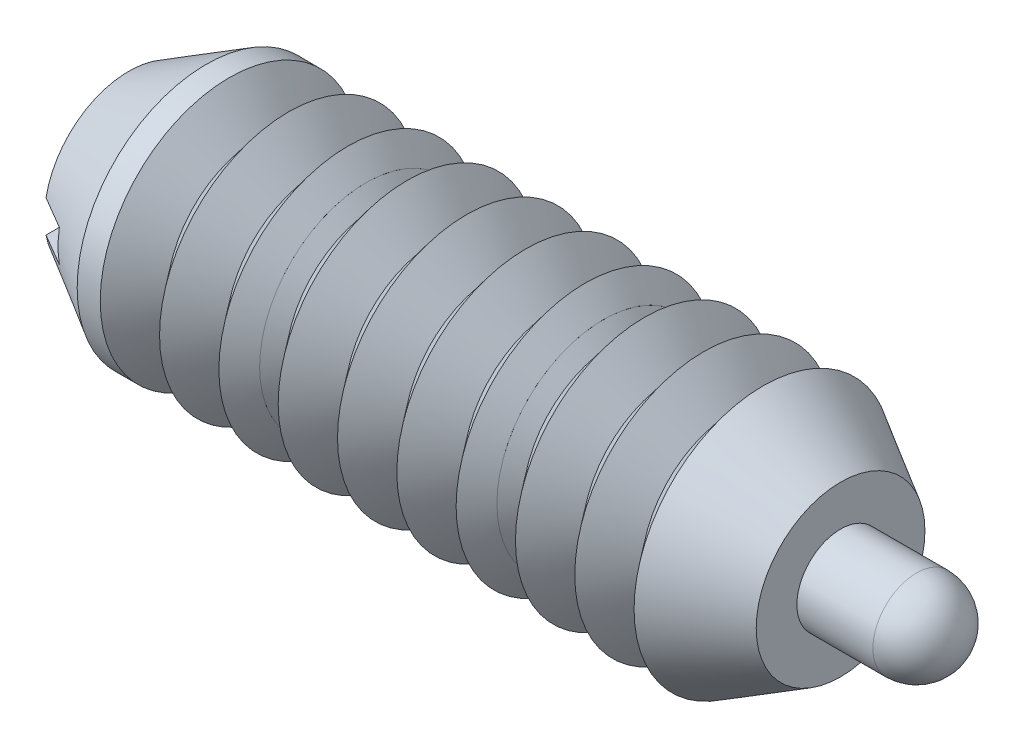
ISO-10303-21;
HEADER;
FILE_DESCRIPTION(('STEP AP214'),'2;1');
FILE_NAME('part.step','',(''),(''),'','','');
FILE_SCHEMA(('AUTOMOTIVE_DESIGN { 1 0 10303 214 1 1 1 1 }'));
ENDSEC;
DATA;
#1=APPLICATION_CONTEXT('core data for automotive mechanical design processes');
#2=APPLICATION_PROTOCOL_DEFINITION('international standard','automotive_design',2000,#1);
#3=PRODUCT_CONTEXT('',#1,'mechanical');
#4=PRODUCT('Part','Part','',(#3));
#5=PRODUCT_RELATED_PRODUCT_CATEGORY('part','',(#4));
#6=PRODUCT_DEFINITION_FORMATION('','',#4);
#7=PRODUCT_DEFINITION_CONTEXT('part definition',#1,'design');
#8=PRODUCT_DEFINITION('design','',#6,#7);
#9=PRODUCT_DEFINITION_SHAPE('','',#8);
#10=(LENGTH_UNIT() NAMED_UNIT(*) SI_UNIT(.MILLI.,.METRE.));
#11=(NAMED_UNIT(*) PLANE_ANGLE_UNIT() SI_UNIT($,.RADIAN.));
#12=(NAMED_UNIT(*) SI_UNIT($,.STERADIAN.) SOLID_ANGLE_UNIT());
#13=UNCERTAINTY_MEASURE_WITH_UNIT(LENGTH_MEASURE(1.E-05),#10,'distance_accuracy_value','');
#14=(GEOMETRIC_REPRESENTATION_CONTEXT(3) GLOBAL_UNCERTAINTY_ASSIGNED_CONTEXT((#13)) GLOBAL_UNIT_ASSIGNED_CONTEXT((#10,
#11,#12)) REPRESENTATION_CONTEXT('',''));
#15=CARTESIAN_POINT('',(0.,0.,0.));
#16=DIRECTION('',(0.,0.,1.));
#17=DIRECTION('',(1.,0.,0.));
#18=AXIS2_PLACEMENT_3D('',#15,#16,#17);
#19=CARTESIAN_POINT('',(8.18134,0.,0.));
#20=DIRECTION('',(-1.,0.,0.));
#21=DIRECTION('',(0.,-0.719424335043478,-0.694570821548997));
#22=AXIS2_PLACEMENT_3D('',#19,#20,#21);
#23=PLANE('',#22);
#24=CARTESIAN_POINT('',(8.18134,0.,0.));
#25=DIRECTION('',(1.,0.,0.));
#26=DIRECTION('',(0.,0.719424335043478,0.694570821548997));
#27=AXIS2_PLACEMENT_3D('',#24,#25,#26);
#28=CIRCLE('',#27,0.5842);
#29=CARTESIAN_POINT('',(8.18134,0.4202876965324,0.405768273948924));
#30=VERTEX_POINT('',#29);
#31=EDGE_CURVE('P0_E10',#30,#30,#28,.T.);
#32=ORIENTED_EDGE('',*,*,#31,.F.);
#33=EDGE_LOOP('',(#32));
#34=FACE_BOUND('',#33,.T.);
#35=ADVANCED_FACE('P0_F14',(#34),#23,.T.);
#36=CARTESIAN_POINT('',(8.29818,0.,0.));
#37=DIRECTION('',(1.,0.,0.));
#38=DIRECTION('',(0.,0.719424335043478,0.694570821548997));
#39=AXIS2_PLACEMENT_3D('',#36,#37,#38);
#40=CONICAL_SURFACE('',#39,0.70104,0.785398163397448);
#41=ORIENTED_EDGE('',*,*,#31,.T.);
#42=EDGE_LOOP('',(#41));
#43=FACE_BOUND('',#42,.T.);
#44=CARTESIAN_POINT('',(8.29818,0.,0.));
#45=DIRECTION('',(1.,0.,0.));
#46=DIRECTION('',(0.,0.719424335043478,0.694570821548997));
#47=AXIS2_PLACEMENT_3D('',#44,#45,#46);
#48=CIRCLE('',#47,0.70104);
#49=CARTESIAN_POINT('',(8.29818,0.50434523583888,0.486921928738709));
#50=VERTEX_POINT('',#49);
#51=EDGE_CURVE('P0_E20',#50,#50,#48,.T.);
#52=ORIENTED_EDGE('',*,*,#51,.F.);
#53=EDGE_LOOP('',(#52));
#54=FACE_BOUND('',#53,.T.);
#55=ADVANCED_FACE('P0_F54',(#43,#54),#40,.T.);
#56=CARTESIAN_POINT('',(11.1252,0.,0.));
#57=DIRECTION('',(1.,0.,0.));
#58=DIRECTION('',(0.,0.719424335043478,0.694570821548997));
#59=AXIS2_PLACEMENT_3D('',#56,#57,#58);
#60=CYLINDRICAL_SURFACE('',#59,0.70104);
#61=ORIENTED_EDGE('',*,*,#51,.T.);
#62=EDGE_LOOP('',(#61));
#63=FACE_BOUND('',#62,.T.);
#64=CARTESIAN_POINT('',(9.14736718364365,0.,0.));
#65=DIRECTION('',(1.,0.,0.));
#66=DIRECTION('',(0.,0.719424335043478,0.694570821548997));
#67=AXIS2_PLACEMENT_3D('',#64,#65,#66);
#68=CIRCLE('',#67,0.70104);
#69=CARTESIAN_POINT('',(9.14736718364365,0.50434523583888,0.486921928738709));
#70=VERTEX_POINT('',#69);
#71=EDGE_CURVE('P0_E24',#70,#70,#68,.T.);
#72=ORIENTED_EDGE('',*,*,#71,.F.);
#73=EDGE_LOOP('',(#72));
#74=FACE_BOUND('',#73,.T.);
#75=ADVANCED_FACE('P0_F50',(#63,#74),#60,.T.);
#76=CARTESIAN_POINT('',(9.34974,0.,0.));
#77=DIRECTION('',(-1.,0.,0.));
#78=DIRECTION('',(0.,-0.719424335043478,-0.694570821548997));
#79=AXIS2_PLACEMENT_3D('',#76,#77,#78);
#80=CONICAL_SURFACE('',#79,0.5842,0.523598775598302);
#81=ORIENTED_EDGE('',*,*,#71,.T.);
#82=EDGE_LOOP('',(#81));
#83=FACE_BOUND('',#82,.T.);
#84=CARTESIAN_POINT('',(9.34974,0.,0.));
#85=DIRECTION('',(1.,0.,0.));
#86=DIRECTION('',(0.,0.719424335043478,0.694570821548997));
#87=AXIS2_PLACEMENT_3D('',#84,#85,#86);
#88=CIRCLE('',#87,0.5842);
#89=CARTESIAN_POINT('',(9.34974,0.4202876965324,0.405768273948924));
#90=VERTEX_POINT('',#89);
#91=EDGE_CURVE('P0_E28',#90,#90,#88,.T.);
#92=ORIENTED_EDGE('',*,*,#91,.F.);
#93=EDGE_LOOP('',(#92));
#94=FACE_BOUND('',#93,.T.);
#95=ADVANCED_FACE('P0_F41',(#83,#94),#80,.T.);
#96=CARTESIAN_POINT('',(11.1252,0.,0.));
#97=DIRECTION('',(1.,0.,0.));
#98=DIRECTION('',(0.,0.719424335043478,0.694570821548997));
#99=AXIS2_PLACEMENT_3D('',#96,#97,#98);
#100=CYLINDRICAL_SURFACE('',#99,0.5842);
#101=ORIENTED_EDGE('',*,*,#91,.T.);
#102=EDGE_LOOP('',(#101));
#103=FACE_BOUND('',#102,.T.);
#104=CARTESIAN_POINT('',(10.541,0.,0.));
#105=DIRECTION('',(1.,0.,0.));
#106=DIRECTION('',(0.,0.719424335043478,0.694570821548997));
#107=AXIS2_PLACEMENT_3D('',#104,#105,#106);
#108=CIRCLE('',#107,0.5842);
#109=CARTESIAN_POINT('',(10.541,0.4202876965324,0.405768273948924));
#110=VERTEX_POINT('',#109);
#111=EDGE_CURVE('P0_E33',#110,#110,#108,.T.);
#112=ORIENTED_EDGE('',*,*,#111,.F.);
#113=EDGE_LOOP('',(#112));
#114=FACE_BOUND('',#113,.T.);
#115=ADVANCED_FACE('P0_F39',(#103,#114),#100,.T.);
#116=CARTESIAN_POINT('',(10.541,0.,0.));
#117=DIRECTION('',(1.,0.,0.));
#118=DIRECTION('',(0.,-0.719424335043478,-0.694570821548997));
#119=AXIS2_PLACEMENT_3D('',#116,#117,#118);
#120=SPHERICAL_SURFACE('',#119,0.5842);
#121=ORIENTED_EDGE('',*,*,#111,.T.);
#122=EDGE_LOOP('',(#121));
#123=FACE_BOUND('',#122,.T.);
#124=ADVANCED_FACE('P0_F37',(#123),#120,.T.);
#125=CLOSED_SHELL('',(#35,#55,#75,#95,#115,#124));
#126=MANIFOLD_SOLID_BREP('P0_B1',#125);
#127=CARTESIAN_POINT('',(3.175,3.4544,-1.7272));
#128=DIRECTION('',(-1.,0.,0.));
#129=DIRECTION('',(0.,-1.,0.));
#130=AXIS2_PLACEMENT_3D('',#127,#128,#129);
#131=PLANE('',#130);
#132=CARTESIAN_POINT('',(3.175,0.,0.));
#133=DIRECTION('',(-1.,0.,0.));
#134=DIRECTION('',(0.,-1.,0.));
#135=AXIS2_PLACEMENT_3D('',#132,#133,#134);
#136=CIRCLE('',#135,1.42423016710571);
#137=CARTESIAN_POINT('',(3.175,-1.42423016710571,0.));
#138=VERTEX_POINT('',#137);
#139=EDGE_CURVE('P1_E31',#138,#138,#136,.F.);
#140=ORIENTED_EDGE('',*,*,#139,.F.);
#141=EDGE_LOOP('',(#140));
#142=FACE_BOUND('',#141,.T.);
#143=CARTESIAN_POINT('',(3.175,0.,0.));
#144=DIRECTION('',(1.,0.,0.));
#145=DIRECTION('',(0.,0.,-1.));
#146=AXIS2_PLACEMENT_3D('',#143,#144,#145);
#147=CIRCLE('',#146,0.726440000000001);
#148=CARTESIAN_POINT('',(3.175,0.,0.726440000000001));
#149=VERTEX_POINT('',#148);
#150=EDGE_CURVE('P1_E47',#149,#149,#147,.T.);
#151=ORIENTED_EDGE('',*,*,#150,.T.);
#152=EDGE_LOOP('',(#151));
#153=FACE_BOUND('',#152,.T.);
#154=ADVANCED_FACE('P1_F14',(#142,#153),#131,.T.);
#155=CARTESIAN_POINT('',(6.35,3.4544,-1.7272));
#156=DIRECTION('',(1.,0.,0.));
#157=DIRECTION('',(0.,1.,0.));
#158=AXIS2_PLACEMENT_3D('',#155,#156,#157);
#159=PLANE('',#158);
#160=CARTESIAN_POINT('',(6.35,0.,0.));
#161=DIRECTION('',(1.,0.,0.));
#162=DIRECTION('',(0.,1.,0.));
#163=AXIS2_PLACEMENT_3D('',#160,#161,#162);
#164=CIRCLE('',#163,1.42423016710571);
#165=CARTESIAN_POINT('',(6.35,1.42423016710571,0.));
#166=VERTEX_POINT('',#165);
#167=EDGE_CURVE('P1_E33',#166,#166,#164,.F.);
#168=ORIENTED_EDGE('',*,*,#167,.F.);
#169=EDGE_LOOP('',(#168));
#170=FACE_BOUND('',#169,.T.);
#171=CARTESIAN_POINT('',(6.35,0.,0.));
#172=DIRECTION('',(1.,0.,0.));
#173=DIRECTION('',(0.,1.,0.));
#174=AXIS2_PLACEMENT_3D('',#171,#172,#173);
#175=CIRCLE('',#174,0.726440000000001);
#176=CARTESIAN_POINT('',(6.35,0.,0.726440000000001));
#177=VERTEX_POINT('',#176);
#178=EDGE_CURVE('P1_E18',#177,#177,#175,.F.);
#179=ORIENTED_EDGE('',*,*,#178,.T.);
#180=EDGE_LOOP('',(#179));
#181=FACE_BOUND('',#180,.T.);
#182=ADVANCED_FACE('P1_F65',(#170,#181),#159,.T.);
#183=CARTESIAN_POINT('',(4.91680500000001,0.,0.));
#184=DIRECTION('',(1.,0.,0.));
#185=DIRECTION('',(0.,0.,-1.));
#186=AXIS2_PLACEMENT_3D('',#183,#184,#185);
#187=CONICAL_SURFACE('',#186,1.23150328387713,0.895664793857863);
#188=CARTESIAN_POINT('',(5.31368000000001,0.,0.));
#189=DIRECTION('',(-1.,0.,0.));
#190=DIRECTION('',(0.,0.,1.));
#191=AXIS2_PLACEMENT_3D('',#188,#189,#190);
#192=CIRCLE('',#191,1.7272);
#193=CARTESIAN_POINT('',(5.31368000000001,0.,1.7272));
#194=VERTEX_POINT('',#193);
#195=EDGE_CURVE('P1_E54',#194,#194,#192,.T.);
#196=ORIENTED_EDGE('',*,*,#195,.T.);
#197=EDGE_LOOP('',(#196));
#198=FACE_BOUND('',#197,.T.);
#199=CARTESIAN_POINT('',(4.91680500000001,0.,0.));
#200=DIRECTION('',(-1.,0.,0.));
#201=DIRECTION('',(0.,0.,1.));
#202=AXIS2_PLACEMENT_3D('',#199,#200,#201);
#203=CIRCLE('',#202,1.23150328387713);
#204=CARTESIAN_POINT('',(4.91680500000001,0.,1.23150328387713));
#205=VERTEX_POINT('',#204);
#206=EDGE_CURVE('P1_E27',#205,#205,#203,.T.);
#207=ORIENTED_EDGE('',*,*,#206,.F.);
#208=EDGE_LOOP('',(#207));
#209=FACE_BOUND('',#208,.T.);
#210=ADVANCED_FACE('P1_F62',(#198,#209),#187,.T.);
#211=CARTESIAN_POINT('',(5.31368000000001,0.,0.));
#212=DIRECTION('',(-1.,0.,0.));
#213=DIRECTION('',(0.,0.,1.));
#214=AXIS2_PLACEMENT_3D('',#211,#212,#213);
#215=CONICAL_SURFACE('',#214,1.7272,0.895664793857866);
#216=CARTESIAN_POINT('',(5.71055500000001,0.,0.));
#217=DIRECTION('',(-1.,0.,0.));
#218=DIRECTION('',(0.,0.,1.));
#219=AXIS2_PLACEMENT_3D('',#216,#217,#218);
#220=CIRCLE('',#219,1.23150328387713);
#221=CARTESIAN_POINT('',(5.71055500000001,0.,1.23150328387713));
#222=VERTEX_POINT('',#221);
#223=EDGE_CURVE('P1_E10',#222,#222,#220,.T.);
#224=ORIENTED_EDGE('',*,*,#223,.T.);
#225=EDGE_LOOP('',(#224));
#226=FACE_BOUND('',#225,.T.);
#227=ORIENTED_EDGE('',*,*,#195,.F.);
#228=EDGE_LOOP('',(#227));
#229=FACE_BOUND('',#228,.T.);
#230=ADVANCED_FACE('P1_F64',(#226,#229),#215,.T.);
#231=CARTESIAN_POINT('',(5.71055500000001,0.,0.));
#232=DIRECTION('',(1.,0.,0.));
#233=DIRECTION('',(0.,0.,-1.));
#234=AXIS2_PLACEMENT_3D('',#231,#232,#233);
#235=CONICAL_SURFACE('',#234,1.23150328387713,0.895664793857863);
#236=CARTESIAN_POINT('',(6.10743000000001,0.,0.));
#237=DIRECTION('',(-1.,0.,0.));
#238=DIRECTION('',(0.,0.,1.));
#239=AXIS2_PLACEMENT_3D('',#236,#237,#238);
#240=CIRCLE('',#239,1.7272);
#241=CARTESIAN_POINT('',(6.10743000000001,0.,1.7272));
#242=VERTEX_POINT('',#241);
#243=EDGE_CURVE('P1_E22',#242,#242,#240,.T.);
#244=ORIENTED_EDGE('',*,*,#243,.T.);
#245=EDGE_LOOP('',(#244));
#246=FACE_BOUND('',#245,.T.);
#247=ORIENTED_EDGE('',*,*,#223,.F.);
#248=EDGE_LOOP('',(#247));
#249=FACE_BOUND('',#248,.T.);
#250=ADVANCED_FACE('P1_F73',(#246,#249),#235,.T.);
#251=CARTESIAN_POINT('',(6.10743000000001,0.,0.));
#252=DIRECTION('',(-1.,0.,0.));
#253=DIRECTION('',(0.,0.,1.));
#254=AXIS2_PLACEMENT_3D('',#251,#252,#253);
#255=CONICAL_SURFACE('',#254,1.7272,0.895664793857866);
#256=ORIENTED_EDGE('',*,*,#243,.F.);
#257=EDGE_LOOP('',(#256));
#258=FACE_BOUND('',#257,.T.);
#259=ORIENTED_EDGE('',*,*,#167,.T.);
#260=EDGE_LOOP('',(#259));
#261=FACE_BOUND('',#260,.T.);
#262=ADVANCED_FACE('P1_F16',(#258,#261),#255,.T.);
#263=CARTESIAN_POINT('',(4.51993000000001,0.,0.));
#264=DIRECTION('',(-1.,0.,0.));
#265=DIRECTION('',(0.,0.,1.));
#266=AXIS2_PLACEMENT_3D('',#263,#264,#265);
#267=CONICAL_SURFACE('',#266,1.7272,0.895664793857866);
#268=ORIENTED_EDGE('',*,*,#206,.T.);
#269=EDGE_LOOP('',(#268));
#270=FACE_BOUND('',#269,.T.);
#271=CARTESIAN_POINT('',(4.51993000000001,0.,0.));
#272=DIRECTION('',(-1.,0.,0.));
#273=DIRECTION('',(0.,0.,1.));
#274=AXIS2_PLACEMENT_3D('',#271,#272,#273);
#275=CIRCLE('',#274,1.7272);
#276=CARTESIAN_POINT('',(4.51993000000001,0.,1.7272));
#277=VERTEX_POINT('',#276);
#278=EDGE_CURVE('P1_E44',#277,#277,#275,.T.);
#279=ORIENTED_EDGE('',*,*,#278,.F.);
#280=EDGE_LOOP('',(#279));
#281=FACE_BOUND('',#280,.T.);
#282=ADVANCED_FACE('P1_F59',(#270,#281),#267,.T.);
#283=CARTESIAN_POINT('',(4.12305500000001,0.,0.));
#284=DIRECTION('',(1.,0.,0.));
#285=DIRECTION('',(0.,0.,-1.));
#286=AXIS2_PLACEMENT_3D('',#283,#284,#285);
#287=CONICAL_SURFACE('',#286,1.23150328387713,0.895664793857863);
#288=ORIENTED_EDGE('',*,*,#278,.T.);
#289=EDGE_LOOP('',(#288));
#290=FACE_BOUND('',#289,.T.);
#291=CARTESIAN_POINT('',(4.12305500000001,0.,0.));
#292=DIRECTION('',(-1.,0.,0.));
#293=DIRECTION('',(0.,0.,1.));
#294=AXIS2_PLACEMENT_3D('',#291,#292,#293);
#295=CIRCLE('',#294,1.23150328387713);
#296=CARTESIAN_POINT('',(4.12305500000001,0.,1.23150328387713));
#297=VERTEX_POINT('',#296);
#298=EDGE_CURVE('P1_E51',#297,#297,#295,.T.);
#299=ORIENTED_EDGE('',*,*,#298,.F.);
#300=EDGE_LOOP('',(#299));
#301=FACE_BOUND('',#300,.T.);
#302=ADVANCED_FACE('P1_F98',(#290,#301),#287,.T.);
#303=CARTESIAN_POINT('',(3.72618000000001,0.,0.));
#304=DIRECTION('',(-1.,0.,0.));
#305=DIRECTION('',(0.,0.,1.));
#306=AXIS2_PLACEMENT_3D('',#303,#304,#305);
#307=CONICAL_SURFACE('',#306,1.7272,0.895664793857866);
#308=ORIENTED_EDGE('',*,*,#298,.T.);
#309=EDGE_LOOP('',(#308));
#310=FACE_BOUND('',#309,.T.);
#311=CARTESIAN_POINT('',(3.72618000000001,0.,0.));
#312=DIRECTION('',(-1.,0.,0.));
#313=DIRECTION('',(0.,0.,1.));
#314=AXIS2_PLACEMENT_3D('',#311,#312,#313);
#315=CIRCLE('',#314,1.7272);
#316=CARTESIAN_POINT('',(3.72618000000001,0.,1.7272));
#317=VERTEX_POINT('',#316);
#318=EDGE_CURVE('P1_E35',#317,#317,#315,.T.);
#319=ORIENTED_EDGE('',*,*,#318,.F.);
#320=EDGE_LOOP('',(#319));
#321=FACE_BOUND('',#320,.T.);
#322=ADVANCED_FACE('P1_F95',(#310,#321),#307,.T.);
#323=CARTESIAN_POINT('',(3.32930500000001,0.,0.));
#324=DIRECTION('',(1.,0.,0.));
#325=DIRECTION('',(0.,0.,-1.));
#326=AXIS2_PLACEMENT_3D('',#323,#324,#325);
#327=CONICAL_SURFACE('',#326,1.23150328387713,0.895664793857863);
#328=ORIENTED_EDGE('',*,*,#318,.T.);
#329=EDGE_LOOP('',(#328));
#330=FACE_BOUND('',#329,.T.);
#331=CARTESIAN_POINT('',(3.32930500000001,0.,0.));
#332=DIRECTION('',(-1.,0.,0.));
#333=DIRECTION('',(0.,0.,1.));
#334=AXIS2_PLACEMENT_3D('',#331,#332,#333);
#335=CIRCLE('',#334,1.23150328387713);
#336=CARTESIAN_POINT('',(3.32930500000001,0.,1.23150328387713));
#337=VERTEX_POINT('',#336);
#338=EDGE_CURVE('P1_E39',#337,#337,#335,.T.);
#339=ORIENTED_EDGE('',*,*,#338,.F.);
#340=EDGE_LOOP('',(#339));
#341=FACE_BOUND('',#340,.T.);
#342=ADVANCED_FACE('P1_F91',(#330,#341),#327,.T.);
#343=CARTESIAN_POINT('',(2.93243000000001,0.,0.));
#344=DIRECTION('',(-1.,0.,0.));
#345=DIRECTION('',(0.,0.,1.));
#346=AXIS2_PLACEMENT_3D('',#343,#344,#345);
#347=CONICAL_SURFACE('',#346,1.7272,0.895664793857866);
#348=ORIENTED_EDGE('',*,*,#338,.T.);
#349=EDGE_LOOP('',(#348));
#350=FACE_BOUND('',#349,.T.);
#351=ORIENTED_EDGE('',*,*,#139,.T.);
#352=EDGE_LOOP('',(#351));
#353=FACE_BOUND('',#352,.T.);
#354=ADVANCED_FACE('P1_F87',(#350,#353),#347,.T.);
#355=CARTESIAN_POINT('',(9.525,0.,0.));
#356=DIRECTION('',(-1.,0.,0.));
#357=DIRECTION('',(0.,0.,1.));
#358=AXIS2_PLACEMENT_3D('',#355,#356,#357);
#359=CYLINDRICAL_SURFACE('',#358,0.726440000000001);
#360=CARTESIAN_POINT('',(6.35,0.,0.726440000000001));
#361=CARTESIAN_POINT('',(6.31692708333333,0.,0.726440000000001));
#362=CARTESIAN_POINT('',(6.28385416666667,0.,0.726440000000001));
#363=CARTESIAN_POINT('',(6.21770833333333,0.,0.726440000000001));
#364=CARTESIAN_POINT('',(6.18463541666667,0.,0.726440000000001));
#365=CARTESIAN_POINT('',(6.11848958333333,0.,0.726440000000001));
#366=CARTESIAN_POINT('',(6.08541666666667,0.,0.726440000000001));
#367=CARTESIAN_POINT('',(6.01927083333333,0.,0.726440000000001));
#368=CARTESIAN_POINT('',(5.98619791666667,0.,0.726440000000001));
#369=CARTESIAN_POINT('',(5.92005208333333,0.,0.726440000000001));
#370=CARTESIAN_POINT('',(5.88697916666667,0.,0.726440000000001));
#371=CARTESIAN_POINT('',(5.82083333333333,0.,0.726440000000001));
#372=CARTESIAN_POINT('',(5.78776041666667,0.,0.726440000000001));
#373=CARTESIAN_POINT('',(5.72161458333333,0.,0.726440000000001));
#374=CARTESIAN_POINT('',(5.68854166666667,0.,0.726440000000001));
#375=CARTESIAN_POINT('',(5.62239583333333,0.,0.726440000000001));
#376=CARTESIAN_POINT('',(5.58932291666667,0.,0.726440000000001));
#377=CARTESIAN_POINT('',(5.52317708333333,0.,0.726440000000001));
#378=CARTESIAN_POINT('',(5.49010416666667,0.,0.726440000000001));
#379=CARTESIAN_POINT('',(5.42395833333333,0.,0.726440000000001));
#380=CARTESIAN_POINT('',(5.39088541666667,0.,0.726440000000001));
#381=CARTESIAN_POINT('',(5.32473958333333,0.,0.726440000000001));
#382=CARTESIAN_POINT('',(5.29166666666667,0.,0.726440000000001));
#383=CARTESIAN_POINT('',(5.22552083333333,0.,0.726440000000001));
#384=CARTESIAN_POINT('',(5.19244791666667,0.,0.726440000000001));
#385=CARTESIAN_POINT('',(5.12630208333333,0.,0.726440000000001));
#386=CARTESIAN_POINT('',(5.09322916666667,0.,0.726440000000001));
#387=CARTESIAN_POINT('',(5.02708333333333,0.,0.726440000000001));
#388=CARTESIAN_POINT('',(4.99401041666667,0.,0.726440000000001));
#389=CARTESIAN_POINT('',(4.92786458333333,0.,0.726440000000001));
#390=CARTESIAN_POINT('',(4.89479166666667,0.,0.726440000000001));
#391=CARTESIAN_POINT('',(4.82864583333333,0.,0.726440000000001));
#392=CARTESIAN_POINT('',(4.79557291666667,0.,0.726440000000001));
#393=CARTESIAN_POINT('',(4.72942708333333,0.,0.726440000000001));
#394=CARTESIAN_POINT('',(4.69635416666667,0.,0.726440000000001));
#395=CARTESIAN_POINT('',(4.63020833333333,0.,0.726440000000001));
#396=CARTESIAN_POINT('',(4.59713541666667,0.,0.726440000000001));
#397=CARTESIAN_POINT('',(4.53098958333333,0.,0.726440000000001));
#398=CARTESIAN_POINT('',(4.49791666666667,0.,0.726440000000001));
#399=CARTESIAN_POINT('',(4.43177083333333,0.,0.726440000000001));
#400=CARTESIAN_POINT('',(4.39869791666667,0.,0.726440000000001));
#401=CARTESIAN_POINT('',(4.33255208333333,0.,0.726440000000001));
#402=CARTESIAN_POINT('',(4.29947916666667,0.,0.726440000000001));
#403=CARTESIAN_POINT('',(4.23333333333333,0.,0.726440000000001));
#404=CARTESIAN_POINT('',(4.20026041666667,0.,0.726440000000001));
#405=CARTESIAN_POINT('',(4.13411458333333,0.,0.726440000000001));
#406=CARTESIAN_POINT('',(4.10104166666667,0.,0.726440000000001));
#407=CARTESIAN_POINT('',(4.03489583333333,0.,0.726440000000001));
#408=CARTESIAN_POINT('',(4.00182291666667,0.,0.726440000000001));
#409=CARTESIAN_POINT('',(3.93567708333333,0.,0.726440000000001));
#410=CARTESIAN_POINT('',(3.90260416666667,0.,0.726440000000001));
#411=CARTESIAN_POINT('',(3.83645833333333,0.,0.726440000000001));
#412=CARTESIAN_POINT('',(3.80338541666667,0.,0.726440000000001));
#413=CARTESIAN_POINT('',(3.73723958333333,0.,0.726440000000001));
#414=CARTESIAN_POINT('',(3.70416666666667,0.,0.726440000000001));
#415=CARTESIAN_POINT('',(3.63802083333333,0.,0.726440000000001));
#416=CARTESIAN_POINT('',(3.60494791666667,0.,0.726440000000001));
#417=CARTESIAN_POINT('',(3.53880208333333,0.,0.726440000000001));
#418=CARTESIAN_POINT('',(3.50572916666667,0.,0.726440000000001));
#419=CARTESIAN_POINT('',(3.43958333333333,0.,0.726440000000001));
#420=CARTESIAN_POINT('',(3.40651041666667,0.,0.726440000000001));
#421=CARTESIAN_POINT('',(3.34036458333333,0.,0.726440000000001));
#422=CARTESIAN_POINT('',(3.30729166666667,0.,0.726440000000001));
#423=CARTESIAN_POINT('',(3.24114583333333,0.,0.726440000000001));
#424=CARTESIAN_POINT('',(3.20807291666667,0.,0.726440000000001));
#425=CARTESIAN_POINT('',(3.175,0.,0.726440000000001));
#426=B_SPLINE_CURVE_WITH_KNOTS('',3,(#360,#361,#362,#363,#364,#365,#366,#367,#368,#369,#370,
#371,#372,#373,#374,#375,#376,#377,#378,#379,#380,#381,#382,#383,#384,#385,#386,#387,#388,#389,
#390,#391,#392,#393,#394,#395,#396,#397,#398,#399,#400,#401,#402,#403,#404,#405,#406,#407,#408,
#409,#410,#411,#412,#413,#414,#415,#416,#417,#418,#419,#420,#421,#422,#423,#424,#425),
.UNSPECIFIED.,.F.,.F.,(4,2,2,2,2,2,2,2,2,2,2,2,2,2,2,2,2,2,2,2,2,2,2,2,2,2,2,2,2,2,2,2,4),(0.,
0.0992187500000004,0.198437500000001,0.29765625,0.396875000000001,0.496093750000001,0.5953125,
0.69453125,0.79375,0.89296875,0.9921875,1.09140625,1.190625,1.28984375,1.3890625,1.48828125,
1.5875,1.68671875,1.7859375,1.88515625,1.984375,2.08359375,2.1828125,2.28203125,2.38125,
2.48046875,2.5796875,2.67890625,2.778125,2.87734375,2.9765625,3.07578125,3.175),.UNSPECIFIED.);
#427=EDGE_CURVE('P1_BSEAM90',#177,#149,#426,.T.);
#428=ORIENTED_EDGE('',*,*,#178,.F.);
#429=ORIENTED_EDGE('',*,*,#150,.F.);
#430=ORIENTED_EDGE('',*,*,#427,.T.);
#431=ORIENTED_EDGE('',*,*,#427,.F.);
#432=EDGE_LOOP('',(#428,#430,#429,#431));
#433=FACE_BOUND('',#432,.T.);
#434=ADVANCED_FACE('P1_F90',(#433),#359,.F.);
#435=CLOSED_SHELL('',(#154,#182,#210,#230,#250,#262,#282,#302,#322,#342,#354,#434));
#436=MANIFOLD_SOLID_BREP('P1_B1',#435);
#437=CARTESIAN_POINT('',(9.525,0.,0.));
#438=DIRECTION('',(1.,0.,0.));
#439=DIRECTION('',(0.,0.,-1.));
#440=AXIS2_PLACEMENT_3D('',#437,#438,#439);
#441=PLANE('',#440);
#442=CARTESIAN_POINT('',(9.525,0.,0.));
#443=DIRECTION('',(1.,0.,0.));
#444=DIRECTION('',(0.,0.,-1.));
#445=AXIS2_PLACEMENT_3D('',#442,#443,#444);
#446=CIRCLE('',#445,1.12888036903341);
#447=CARTESIAN_POINT('',(9.525,0.,-1.12888036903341));
#448=VERTEX_POINT('',#447);
#449=EDGE_CURVE('P2_E79',#448,#448,#446,.T.);
#450=ORIENTED_EDGE('',*,*,#449,.T.);
#451=EDGE_LOOP('',(#450));
#452=FACE_BOUND('',#451,.T.);
#453=CARTESIAN_POINT('',(9.525,0.,0.));
#454=DIRECTION('',(-1.,0.,0.));
#455=DIRECTION('',(0.,0.,1.));
#456=AXIS2_PLACEMENT_3D('',#453,#454,#455);
#457=CIRCLE('',#456,0.5842);
#458=CARTESIAN_POINT('',(9.525,0.,0.5842));
#459=VERTEX_POINT('',#458);
#460=EDGE_CURVE('P2_E66',#459,#459,#457,.T.);
#461=ORIENTED_EDGE('',*,*,#460,.T.);
#462=EDGE_LOOP('',(#461));
#463=FACE_BOUND('',#462,.T.);
#464=ADVANCED_FACE('P2_F15',(#452,#463),#441,.T.);
#465=CARTESIAN_POINT('',(9.525,0.,0.));
#466=DIRECTION('',(-1.,0.,0.));
#467=DIRECTION('',(0.,0.,1.));
#468=AXIS2_PLACEMENT_3D('',#465,#466,#467);
#469=CONICAL_SURFACE('',#468,1.12888036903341,0.523598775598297);
#470=CARTESIAN_POINT('',(8.48868000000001,0.,0.));
#471=DIRECTION('',(-1.,0.,0.));
#472=DIRECTION('',(0.,0.,1.));
#473=AXIS2_PLACEMENT_3D('',#470,#471,#472);
#474=CIRCLE('',#473,1.7272);
#475=CARTESIAN_POINT('',(8.48868000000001,0.,1.7272));
#476=VERTEX_POINT('',#475);
#477=EDGE_CURVE('P2_E151',#476,#476,#474,.T.);
#478=ORIENTED_EDGE('',*,*,#477,.F.);
#479=EDGE_LOOP('',(#478));
#480=FACE_BOUND('',#479,.T.);
#481=ORIENTED_EDGE('',*,*,#449,.F.);
#482=EDGE_LOOP('',(#481));
#483=FACE_BOUND('',#482,.T.);
#484=ADVANCED_FACE('P2_F17',(#480,#483),#469,.T.);
#485=CARTESIAN_POINT('',(0.,0.,0.));
#486=DIRECTION('',(-1.,0.,0.));
#487=DIRECTION('',(0.,0.,1.));
#488=AXIS2_PLACEMENT_3D('',#485,#486,#487);
#489=CYLINDRICAL_SURFACE('',#488,0.5842);
#490=CARTESIAN_POINT('',(9.34974,0.,0.));
#491=DIRECTION('',(-1.,0.,0.));
#492=DIRECTION('',(0.,0.,1.));
#493=AXIS2_PLACEMENT_3D('',#490,#491,#492);
#494=CIRCLE('',#493,0.5842);
#495=CARTESIAN_POINT('',(9.34974,0.,0.5842));
#496=VERTEX_POINT('',#495);
#497=EDGE_CURVE('P2_E163',#496,#496,#494,.T.);
#498=ORIENTED_EDGE('',*,*,#497,.T.);
#499=EDGE_LOOP('',(#498));
#500=FACE_BOUND('',#499,.T.);
#501=ORIENTED_EDGE('',*,*,#460,.F.);
#502=EDGE_LOOP('',(#501));
#503=FACE_BOUND('',#502,.T.);
#504=ADVANCED_FACE('P2_F189',(#500,#503),#489,.F.);
#505=CARTESIAN_POINT('',(9.34974,0.,0.));
#506=DIRECTION('',(-1.,0.,0.));
#507=DIRECTION('',(0.,0.,1.));
#508=AXIS2_PLACEMENT_3D('',#505,#506,#507);
#509=CONICAL_SURFACE('',#508,0.5842,0.785398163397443);
#510=CARTESIAN_POINT('',(9.2329,0.,0.));
#511=DIRECTION('',(-1.,0.,0.));
#512=DIRECTION('',(0.,0.,1.));
#513=AXIS2_PLACEMENT_3D('',#510,#511,#512);
#514=CIRCLE('',#513,0.701040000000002);
#515=CARTESIAN_POINT('',(9.2329,0.,0.701040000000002));
#516=VERTEX_POINT('',#515);
#517=EDGE_CURVE('P2_E160',#516,#516,#514,.T.);
#518=ORIENTED_EDGE('',*,*,#517,.T.);
#519=EDGE_LOOP('',(#518));
#520=FACE_BOUND('',#519,.T.);
#521=ORIENTED_EDGE('',*,*,#497,.F.);
#522=EDGE_LOOP('',(#521));
#523=FACE_BOUND('',#522,.T.);
#524=ADVANCED_FACE('P2_F196',(#520,#523),#509,.F.);
#525=CARTESIAN_POINT('',(0.,0.,0.));
#526=DIRECTION('',(-1.,0.,0.));
#527=DIRECTION('',(0.,0.,1.));
#528=AXIS2_PLACEMENT_3D('',#525,#526,#527);
#529=CYLINDRICAL_SURFACE('',#528,0.701040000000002);
#530=CARTESIAN_POINT('',(1.2954,0.,0.));
#531=DIRECTION('',(-1.,0.,0.));
#532=DIRECTION('',(0.,0.,1.));
#533=AXIS2_PLACEMENT_3D('',#530,#531,#532);
#534=CIRCLE('',#533,0.701040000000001);
#535=CARTESIAN_POINT('',(1.2954,0.,0.701040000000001));
#536=VERTEX_POINT('',#535);
#537=EDGE_CURVE('P2_E157',#536,#536,#534,.T.);
#538=ORIENTED_EDGE('',*,*,#537,.T.);
#539=EDGE_LOOP('',(#538));
#540=FACE_BOUND('',#539,.T.);
#541=ORIENTED_EDGE('',*,*,#517,.F.);
#542=EDGE_LOOP('',(#541));
#543=FACE_BOUND('',#542,.T.);
#544=ADVANCED_FACE('P2_F201',(#540,#543),#529,.F.);
#545=CARTESIAN_POINT('',(1.2954,0.,0.));
#546=DIRECTION('',(1.,0.,0.));
#547=DIRECTION('',(0.,0.,-1.));
#548=AXIS2_PLACEMENT_3D('',#545,#546,#547);
#549=PLANE('',#548);
#550=ORIENTED_EDGE('',*,*,#537,.F.);
#551=EDGE_LOOP('',(#550));
#552=FACE_BOUND('',#551,.T.);
#553=ADVANCED_FACE('P2_F207',(#552),#549,.T.);
#554=CARTESIAN_POINT('',(8.09180500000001,0.,0.));
#555=DIRECTION('',(1.,0.,0.));
#556=DIRECTION('',(0.,0.,-1.));
#557=AXIS2_PLACEMENT_3D('',#554,#555,#556);
#558=CONICAL_SURFACE('',#557,1.23150328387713,0.895664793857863);
#559=ORIENTED_EDGE('',*,*,#477,.T.);
#560=EDGE_LOOP('',(#559));
#561=FACE_BOUND('',#560,.T.);
#562=CARTESIAN_POINT('',(8.09180500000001,0.,0.));
#563=DIRECTION('',(-1.,0.,0.));
#564=DIRECTION('',(0.,0.,1.));
#565=AXIS2_PLACEMENT_3D('',#562,#563,#564);
#566=CIRCLE('',#565,1.23150328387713);
#567=CARTESIAN_POINT('',(8.09180500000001,0.,1.23150328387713));
#568=VERTEX_POINT('',#567);
#569=EDGE_CURVE('P2_E154',#568,#568,#566,.T.);
#570=ORIENTED_EDGE('',*,*,#569,.F.);
#571=EDGE_LOOP('',(#570));
#572=FACE_BOUND('',#571,.T.);
#573=ADVANCED_FACE('P2_F211',(#561,#572),#558,.T.);
#574=CARTESIAN_POINT('',(7.69493000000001,0.,0.));
#575=DIRECTION('',(-1.,0.,0.));
#576=DIRECTION('',(0.,0.,1.));
#577=AXIS2_PLACEMENT_3D('',#574,#575,#576);
#578=CONICAL_SURFACE('',#577,1.7272,0.895664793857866);
#579=ORIENTED_EDGE('',*,*,#569,.T.);
#580=EDGE_LOOP('',(#579));
#581=FACE_BOUND('',#580,.T.);
#582=CARTESIAN_POINT('',(7.69493000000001,0.,0.));
#583=DIRECTION('',(-1.,0.,0.));
#584=DIRECTION('',(0.,0.,1.));
#585=AXIS2_PLACEMENT_3D('',#582,#583,#584);
#586=CIRCLE('',#585,1.7272);
#587=CARTESIAN_POINT('',(7.69493000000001,0.,1.7272));
#588=VERTEX_POINT('',#587);
#589=EDGE_CURVE('P2_E145',#588,#588,#586,.T.);
#590=ORIENTED_EDGE('',*,*,#589,.F.);
#591=EDGE_LOOP('',(#590));
#592=FACE_BOUND('',#591,.T.);
#593=ADVANCED_FACE('P2_F215',(#581,#592),#578,.T.);
#594=CARTESIAN_POINT('',(7.29805500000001,0.,0.));
#595=DIRECTION('',(1.,0.,0.));
#596=DIRECTION('',(0.,0.,-1.));
#597=AXIS2_PLACEMENT_3D('',#594,#595,#596);
#598=CONICAL_SURFACE('',#597,1.23150328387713,0.895664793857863);
#599=ORIENTED_EDGE('',*,*,#589,.T.);
#600=EDGE_LOOP('',(#599));
#601=FACE_BOUND('',#600,.T.);
#602=CARTESIAN_POINT('',(7.29805500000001,0.,0.));
#603=DIRECTION('',(-1.,0.,0.));
#604=DIRECTION('',(0.,0.,1.));
#605=AXIS2_PLACEMENT_3D('',#602,#603,#604);
#606=CIRCLE('',#605,1.23150328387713);
#607=CARTESIAN_POINT('',(7.29805500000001,0.,1.23150328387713));
#608=VERTEX_POINT('',#607);
#609=EDGE_CURVE('P2_E148',#608,#608,#606,.T.);
#610=ORIENTED_EDGE('',*,*,#609,.F.);
#611=EDGE_LOOP('',(#610));
#612=FACE_BOUND('',#611,.T.);
#613=ADVANCED_FACE('P2_F219',(#601,#612),#598,.T.);
#614=CARTESIAN_POINT('',(6.90118000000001,0.,0.));
#615=DIRECTION('',(-1.,0.,0.));
#616=DIRECTION('',(0.,0.,1.));
#617=AXIS2_PLACEMENT_3D('',#614,#615,#616);
#618=CONICAL_SURFACE('',#617,1.7272,0.895664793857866);
#619=ORIENTED_EDGE('',*,*,#609,.T.);
#620=EDGE_LOOP('',(#619));
#621=FACE_BOUND('',#620,.T.);
#622=CARTESIAN_POINT('',(6.90118000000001,0.,0.));
#623=DIRECTION('',(-1.,0.,0.));
#624=DIRECTION('',(0.,0.,1.));
#625=AXIS2_PLACEMENT_3D('',#622,#623,#624);
#626=CIRCLE('',#625,1.7272);
#627=CARTESIAN_POINT('',(6.90118000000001,0.,1.7272));
#628=VERTEX_POINT('',#627);
#629=EDGE_CURVE('P2_E139',#628,#628,#626,.T.);
#630=ORIENTED_EDGE('',*,*,#629,.F.);
#631=EDGE_LOOP('',(#630));
#632=FACE_BOUND('',#631,.T.);
#633=ADVANCED_FACE('P2_F223',(#621,#632),#618,.T.);
#634=CARTESIAN_POINT('',(6.50430500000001,0.,0.));
#635=DIRECTION('',(1.,0.,0.));
#636=DIRECTION('',(0.,0.,-1.));
#637=AXIS2_PLACEMENT_3D('',#634,#635,#636);
#638=CONICAL_SURFACE('',#637,1.23150328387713,0.895664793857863);
#639=ORIENTED_EDGE('',*,*,#629,.T.);
#640=EDGE_LOOP('',(#639));
#641=FACE_BOUND('',#640,.T.);
#642=CARTESIAN_POINT('',(6.50430500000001,0.,0.));
#643=DIRECTION('',(-1.,0.,0.));
#644=DIRECTION('',(0.,0.,1.));
#645=AXIS2_PLACEMENT_3D('',#642,#643,#644);
#646=CIRCLE('',#645,1.23150328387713);
#647=CARTESIAN_POINT('',(6.50430500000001,0.,1.23150328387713));
#648=VERTEX_POINT('',#647);
#649=EDGE_CURVE('P2_E142',#648,#648,#646,.T.);
#650=ORIENTED_EDGE('',*,*,#649,.F.);
#651=EDGE_LOOP('',(#650));
#652=FACE_BOUND('',#651,.T.);
#653=ADVANCED_FACE('P2_F227',(#641,#652),#638,.T.);
#654=CARTESIAN_POINT('',(6.10743000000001,0.,0.));
#655=DIRECTION('',(-1.,0.,0.));
#656=DIRECTION('',(0.,0.,1.));
#657=AXIS2_PLACEMENT_3D('',#654,#655,#656);
#658=CONICAL_SURFACE('',#657,1.7272,0.895664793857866);
#659=CARTESIAN_POINT('',(6.35,0.,0.));
#660=DIRECTION('',(1.,0.,0.));
#661=DIRECTION('',(0.,0.,-1.));
#662=AXIS2_PLACEMENT_3D('',#659,#660,#661);
#663=CIRCLE('',#662,1.42423016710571);
#664=CARTESIAN_POINT('',(6.35,0.,-1.42423016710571));
#665=VERTEX_POINT('',#664);
#666=EDGE_CURVE('P2_E19',#665,#665,#663,.F.);
#667=ORIENTED_EDGE('',*,*,#666,.F.);
#668=EDGE_LOOP('',(#667));
#669=FACE_BOUND('',#668,.T.);
#670=ORIENTED_EDGE('',*,*,#649,.T.);
#671=EDGE_LOOP('',(#670));
#672=FACE_BOUND('',#671,.T.);
#673=ADVANCED_FACE('P2_F231',(#669,#672),#658,.T.);
#674=CARTESIAN_POINT('',(3.175,0.,0.));
#675=DIRECTION('',(1.,0.,0.));
#676=DIRECTION('',(0.,0.,-1.));
#677=AXIS2_PLACEMENT_3D('',#674,#675,#676);
#678=PLANE('',#677);
#679=CARTESIAN_POINT('',(3.175,0.,0.));
#680=DIRECTION('',(1.,0.,0.));
#681=DIRECTION('',(0.,0.,-1.));
#682=AXIS2_PLACEMENT_3D('',#679,#680,#681);
#683=CIRCLE('',#682,1.42423016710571);
#684=CARTESIAN_POINT('',(3.175,0.,-1.42423016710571));
#685=VERTEX_POINT('',#684);
#686=EDGE_CURVE('P2_E110',#685,#685,#683,.F.);
#687=ORIENTED_EDGE('',*,*,#686,.F.);
#688=EDGE_LOOP('',(#687));
#689=FACE_BOUND('',#688,.T.);
#690=CARTESIAN_POINT('',(3.175,0.,0.));
#691=DIRECTION('',(1.,0.,0.));
#692=DIRECTION('',(0.,0.,-1.));
#693=AXIS2_PLACEMENT_3D('',#690,#691,#692);
#694=CIRCLE('',#693,0.726440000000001);
#695=CARTESIAN_POINT('',(3.175,0.,-0.726440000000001));
#696=VERTEX_POINT('',#695);
#697=EDGE_CURVE('P2_E112',#696,#696,#694,.T.);
#698=ORIENTED_EDGE('',*,*,#697,.F.);
#699=EDGE_LOOP('',(#698));
#700=FACE_BOUND('',#699,.T.);
#701=ADVANCED_FACE('P2_F235',(#689,#700),#678,.T.);
#702=CARTESIAN_POINT('',(11.3766806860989,0.,0.));
#703=DIRECTION('',(-1.,0.,0.));
#704=DIRECTION('',(0.,0.,1.));
#705=AXIS2_PLACEMENT_3D('',#702,#703,#704);
#706=CYLINDRICAL_SURFACE('',#705,0.726440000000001);
#707=ORIENTED_EDGE('',*,*,#697,.T.);
#708=EDGE_LOOP('',(#707));
#709=FACE_BOUND('',#708,.T.);
#710=CARTESIAN_POINT('',(6.35,0.,0.));
#711=DIRECTION('',(1.,0.,0.));
#712=DIRECTION('',(0.,0.,-1.));
#713=AXIS2_PLACEMENT_3D('',#710,#711,#712);
#714=CIRCLE('',#713,0.726440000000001);
#715=CARTESIAN_POINT('',(6.35,0.,-0.726440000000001));
#716=VERTEX_POINT('',#715);
#717=EDGE_CURVE('P2_E118',#716,#716,#714,.T.);
#718=ORIENTED_EDGE('',*,*,#717,.F.);
#719=EDGE_LOOP('',(#718));
#720=FACE_BOUND('',#719,.T.);
#721=ADVANCED_FACE('P2_F180',(#709,#720),#706,.T.);
#722=CARTESIAN_POINT('',(6.35,0.,0.));
#723=DIRECTION('',(1.,0.,0.));
#724=DIRECTION('',(0.,0.,-1.));
#725=AXIS2_PLACEMENT_3D('',#722,#723,#724);
#726=PLANE('',#725);
#727=ORIENTED_EDGE('',*,*,#666,.T.);
#728=EDGE_LOOP('',(#727));
#729=FACE_BOUND('',#728,.T.);
#730=ORIENTED_EDGE('',*,*,#717,.T.);
#731=EDGE_LOOP('',(#730));
#732=FACE_BOUND('',#731,.T.);
#733=ADVANCED_FACE('P2_F175',(#729,#732),#726,.F.);
#734=CARTESIAN_POINT('',(0.,0.,0.));
#735=DIRECTION('',(1.,0.,0.));
#736=DIRECTION('',(0.,0.,-1.));
#737=AXIS2_PLACEMENT_3D('',#734,#735,#736);
#738=PLANE('',#737);
#739=CARTESIAN_POINT('',(0.,0.,0.));
#740=DIRECTION('',(1.,0.,0.));
#741=DIRECTION('',(0.,0.,-1.));
#742=AXIS2_PLACEMENT_3D('',#739,#740,#741);
#743=CIRCLE('',#742,1.12888036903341);
#744=CARTESIAN_POINT('',(0.,-0.2159,-1.10804245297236));
#745=VERTEX_POINT('',#744);
#746=CARTESIAN_POINT('',(0.,-0.2159,1.10804245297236));
#747=VERTEX_POINT('',#746);
#748=EDGE_CURVE('P2_E75',#745,#747,#743,.F.);
#749=ORIENTED_EDGE('',*,*,#748,.T.);
#750=DIRECTION('',(0.,0.,1.));
#751=VECTOR('',#750,1.);
#752=CARTESIAN_POINT('',(0.,-0.2159,-1.7272));
#753=LINE('',#752,#751);
#754=EDGE_CURVE('P2_E33',#745,#747,#753,.T.);
#755=ORIENTED_EDGE('',*,*,#754,.F.);
#756=EDGE_LOOP('',(#749,#755));
#757=FACE_BOUND('',#756,.T.);
#758=ADVANCED_FACE('P2_F101',(#757),#738,.F.);
#759=CARTESIAN_POINT('',(0.,-0.2159,-1.7272));
#760=DIRECTION('',(0.,-1.,0.));
#761=DIRECTION('',(0.,0.,-1.));
#762=AXIS2_PLACEMENT_3D('',#759,#760,#761);
#763=PLANE('',#762);
#764=CARTESIAN_POINT('',(2.52076973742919,-0.2159,-2.57521302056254));
#765=CARTESIAN_POINT('',(2.26907100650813,-0.2159,-2.42936283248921));
#766=CARTESIAN_POINT('',(2.01739148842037,-0.2159,-2.28347947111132));
#767=CARTESIAN_POINT('',(1.51411985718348,-0.2159,-1.99144810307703));
#768=CARTESIAN_POINT('',(1.26252777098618,-0.2159,-1.84530004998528));
#769=CARTESIAN_POINT('',(0.766134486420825,-0.2159,-1.55641330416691));
#770=CARTESIAN_POINT('',(0.521327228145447,-0.2159,-1.41368504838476));
#771=CARTESIAN_POINT('',(0.154558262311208,-0.2159,-1.19888559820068));
#772=CARTESIAN_POINT('',(0.0323859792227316,-0.2159,-1.12717407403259));
#773=CARTESIAN_POINT('',(-0.211712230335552,-0.2159,-0.983333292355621));
#774=CARTESIAN_POINT('',(-0.333638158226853,-0.2159,-0.91120403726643));
#775=CARTESIAN_POINT('',(-0.516489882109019,-0.2159,-0.802187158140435));
#776=CARTESIAN_POINT('',(-0.577600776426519,-0.2159,-0.76561020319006));
#777=CARTESIAN_POINT('',(-0.699649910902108,-0.2159,-0.692121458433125));
#778=CARTESIAN_POINT('',(-0.760588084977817,-0.2159,-0.655209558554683));
#779=CARTESIAN_POINT('',(-0.882776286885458,-0.2159,-0.580482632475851));
#780=CARTESIAN_POINT('',(-0.944023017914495,-0.2159,-0.542662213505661));
#781=CARTESIAN_POINT('',(-1.06588953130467,-0.2159,-0.466147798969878));
#782=CARTESIAN_POINT('',(-1.12650988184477,-0.2159,-0.427454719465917));
#783=CARTESIAN_POINT('',(-1.21652495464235,-0.2159,-0.367962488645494));
#784=CARTESIAN_POINT('',(-1.24638993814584,-0.2159,-0.347880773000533));
#785=CARTESIAN_POINT('',(-1.30566636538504,-0.2159,-0.306888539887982));
#786=CARTESIAN_POINT('',(-1.33507634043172,-0.2159,-0.285975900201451));
#787=CARTESIAN_POINT('',(-1.39267749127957,-0.2159,-0.243069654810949));
#788=CARTESIAN_POINT('',(-1.4208779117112,-0.2159,-0.22108894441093));
#789=CARTESIAN_POINT('',(-1.46155161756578,-0.2159,-0.186312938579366));
#790=CARTESIAN_POINT('',(-1.47481212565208,-0.2159,-0.174446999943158));
#791=CARTESIAN_POINT('',(-1.50045016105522,-0.2159,-0.149806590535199));
#792=CARTESIAN_POINT('',(-1.51282906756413,-0.2159,-0.137033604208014));
#793=CARTESIAN_POINT('',(-1.53273895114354,-0.2159,-0.113887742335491));
#794=CARTESIAN_POINT('',(-1.54065414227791,-0.2159,-0.103850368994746));
#795=CARTESIAN_POINT('',(-1.55510063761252,-0.2159,-0.0828292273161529));
#796=CARTESIAN_POINT('',(-1.56163718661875,-0.2159,-0.0718492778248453));
#797=CARTESIAN_POINT('',(-1.57031869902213,-0.2159,-0.0532120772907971));
#798=CARTESIAN_POINT('',(-1.57318609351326,-0.2159,-0.0458986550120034));
#799=CARTESIAN_POINT('',(-1.57773136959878,-0.2159,-0.0309072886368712));
#800=CARTESIAN_POINT('',(-1.57941083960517,-0.2159,-0.0232298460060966));
#801=CARTESIAN_POINT('',(-1.58133938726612,-0.2159,-0.00762162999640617));
#802=CARTESIAN_POINT('',(-1.58157606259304,-0.2159,0.000310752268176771));
#803=CARTESIAN_POINT('',(-1.58054244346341,-0.2159,0.0160744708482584));
#804=CARTESIAN_POINT('',(-1.57927148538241,-0.2159,0.0239057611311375));
#805=CARTESIAN_POINT('',(-1.57503021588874,-0.2159,0.0408376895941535));
#806=CARTESIAN_POINT('',(-1.57175971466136,-0.2159,0.0498606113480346));
#807=CARTESIAN_POINT('',(-1.56385958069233,-0.2159,0.0672912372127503));
#808=CARTESIAN_POINT('',(-1.55922583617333,-0.2159,0.0756969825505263));
#809=CARTESIAN_POINT('',(-1.54754837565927,-0.2159,0.0943298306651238));
#810=CARTESIAN_POINT('',(-1.54019727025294,-0.2159,0.104359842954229));
#811=CARTESIAN_POINT('',(-1.52456878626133,-0.2159,0.123680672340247));
#812=CARTESIAN_POINT('',(-1.51628937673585,-0.2159,0.132969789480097));
#813=CARTESIAN_POINT('',(-1.49908583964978,-0.2159,0.151046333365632));
#814=CARTESIAN_POINT('',(-1.49015765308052,-0.2159,0.159829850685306));
#815=CARTESIAN_POINT('',(-1.4719113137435,-0.2159,0.176956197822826));
#816=CARTESIAN_POINT('',(-1.46259360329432,-0.2159,0.185299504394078));
#817=CARTESIAN_POINT('',(-1.43214775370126,-0.2159,0.211647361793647));
#818=CARTESIAN_POINT('',(-1.41047768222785,-0.2159,0.229022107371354));
#819=CARTESIAN_POINT('',(-1.366425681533,-0.2159,0.262850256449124));
#820=CARTESIAN_POINT('',(-1.34404329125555,-0.2159,0.279303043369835));
#821=CARTESIAN_POINT('',(-1.27618808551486,-0.2159,0.32784450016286));
#822=CARTESIAN_POINT('',(-1.23008782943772,-0.2159,0.359052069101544));
#823=CARTESIAN_POINT('',(-1.13727199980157,-0.2159,0.42028564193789));
#824=CARTESIAN_POINT('',(-1.09055799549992,-0.2159,0.450314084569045));
#825=CARTESIAN_POINT('',(-0.996772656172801,-0.2159,0.509685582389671));
#826=CARTESIAN_POINT('',(-0.949701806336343,-0.2159,0.539029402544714));
#827=CARTESIAN_POINT('',(-0.808685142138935,-0.2159,0.626133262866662));
#828=CARTESIAN_POINT('',(-0.714385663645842,-0.2159,0.6833177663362));
#829=CARTESIAN_POINT('',(-0.525361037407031,-0.2159,0.796982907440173));
#830=CARTESIAN_POINT('',(-0.430635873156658,-0.2159,0.853463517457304));
#831=CARTESIAN_POINT('',(-0.240898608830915,-0.2159,0.966051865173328));
#832=CARTESIAN_POINT('',(-0.145886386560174,-0.2159,1.02215939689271));
#833=CARTESIAN_POINT('',(0.044279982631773,-0.2159,1.13412951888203));
#834=CARTESIAN_POINT('',(0.139434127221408,-0.2159,1.18999211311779));
#835=CARTESIAN_POINT('',(0.42491611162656,-0.2159,1.35727616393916));
#836=CARTESIAN_POINT('',(0.615381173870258,-0.2159,1.46846336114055));
#837=CARTESIAN_POINT('',(0.996459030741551,-0.2159,1.69051904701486));
#838=CARTESIAN_POINT('',(1.1870717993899,-0.2159,1.80138758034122));
#839=CARTESIAN_POINT('',(1.47293646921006,-0.2159,1.96747984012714));
#840=CARTESIAN_POINT('',(1.56814948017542,-0.2159,2.02277049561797));
#841=CARTESIAN_POINT('',(1.75859942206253,-0.2159,2.13331873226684));
#842=CARTESIAN_POINT('',(1.85383635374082,-0.2159,2.18857631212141));
#843=CARTESIAN_POINT('',(2.04435035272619,-0.2159,2.29907763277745));
#844=CARTESIAN_POINT('',(2.13962742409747,-0.2159,2.35432136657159));
#845=CARTESIAN_POINT('',(2.3301912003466,-0.2159,2.46478402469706));
#846=CARTESIAN_POINT('',(2.42547790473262,-0.2159,2.52000294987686));
#847=CARTESIAN_POINT('',(2.52076973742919,-0.2159,2.57521302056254));
#848=B_SPLINE_CURVE_WITH_KNOTS('',3,(#764,#765,#766,#767,#768,#769,#770,#771,#772,#773,#774,
#775,#776,#777,#778,#779,#780,#781,#782,#783,#784,#785,#786,#787,#788,#789,#790,#791,#792,#793,
#794,#795,#796,#797,#798,#799,#800,#801,#802,#803,#804,#805,#806,#807,#808,#809,#810,#811,#812,
#813,#814,#815,#816,#817,#818,#819,#820,#821,#822,#823,#824,#825,#826,#827,#828,#829,#830,#831,
#832,#833,#834,#835,#836,#837,#838,#839,#840,#841,#842,#843,#844,#845,#846,#847),.UNSPECIFIED.,
.F.,.F.,(4,2,2,2,2,2,2,2,2,2,2,2,2,2,2,2,2,2,2,2,2,2,2,2,2,2,2,2,2,2,2,2,2,2,2,2,2,2,2,2,2,4),
(0.,0.872708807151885,1.74558937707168,2.59571598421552,3.02070691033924,3.44569537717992,
3.65935755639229,3.87309269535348,4.08903923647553,4.30476877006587,4.41272561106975,
4.52097856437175,4.62814939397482,4.68151041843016,4.73478604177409,4.77307600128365,
4.81121755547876,4.83470763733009,4.85816625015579,4.88182623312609,4.90549663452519,
4.93412513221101,4.96284087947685,5.00005407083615,5.03735032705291,5.07490425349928,
5.11241663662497,5.19568832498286,5.27901505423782,5.44597717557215,5.61257352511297,
5.77897382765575,6.10981683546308,6.44067278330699,6.77169833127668,7.1027184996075,
7.76434889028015,8.42588154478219,8.75618921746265,9.08650914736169,9.4169124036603,
9.74730333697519),.UNSPECIFIED.);
#849=CARTESIAN_POINT('',(0.4318,-0.2159,-1.36116416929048));
#850=VERTEX_POINT('',#849);
#851=EDGE_CURVE('P2_E92',#850,#745,#848,.T.);
#852=ORIENTED_EDGE('',*,*,#851,.T.);
#853=ORIENTED_EDGE('',*,*,#754,.T.);
#854=CARTESIAN_POINT('',(0.4318,-0.2159,1.36116416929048));
#855=VERTEX_POINT('',#854);
#856=EDGE_CURVE('P2_E86',#747,#855,#848,.T.);
#857=ORIENTED_EDGE('',*,*,#856,.T.);
#858=DIRECTION('',(0.,0.,1.));
#859=VECTOR('',#858,1.);
#860=CARTESIAN_POINT('',(0.4318,-0.2159,-1.7272));
#861=LINE('',#860,#859);
#862=EDGE_CURVE('P2_E169',#850,#855,#861,.T.);
#863=ORIENTED_EDGE('',*,*,#862,.F.);
#864=EDGE_LOOP('',(#852,#853,#857,#863));
#865=FACE_BOUND('',#864,.T.);
#866=ADVANCED_FACE('P2_F95',(#865),#763,.F.);
#867=CARTESIAN_POINT('',(0.4318,0.2159,-1.7272));
#868=DIRECTION('',(1.,0.,0.));
#869=DIRECTION('',(0.,0.,-1.));
#870=AXIS2_PLACEMENT_3D('',#867,#868,#869);
#871=PLANE('',#870);
#872=CARTESIAN_POINT('',(0.4318,0.,0.));
#873=DIRECTION('',(1.,0.,0.));
#874=DIRECTION('',(0.,0.,-1.));
#875=AXIS2_PLACEMENT_3D('',#872,#873,#874);
#876=CIRCLE('',#875,1.37818021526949);
#877=CARTESIAN_POINT('',(0.4318,0.2159,1.36116416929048));
#878=VERTEX_POINT('',#877);
#879=EDGE_CURVE('P2_E41',#855,#878,#876,.F.);
#880=ORIENTED_EDGE('',*,*,#879,.T.);
#881=DIRECTION('',(0.,0.,1.));
#882=VECTOR('',#881,1.);
#883=CARTESIAN_POINT('',(0.4318,0.2159,-1.7272));
#884=LINE('',#883,#882);
#885=CARTESIAN_POINT('',(0.4318,0.2159,-1.36116416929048));
#886=VERTEX_POINT('',#885);
#887=EDGE_CURVE('P2_E81',#886,#878,#884,.T.);
#888=ORIENTED_EDGE('',*,*,#887,.F.);
#889=EDGE_CURVE('P2_E24',#886,#850,#876,.F.);
#890=ORIENTED_EDGE('',*,*,#889,.T.);
#891=ORIENTED_EDGE('',*,*,#862,.T.);
#892=EDGE_LOOP('',(#880,#888,#890,#891));
#893=FACE_BOUND('',#892,.T.);
#894=ADVANCED_FACE('P2_F100',(#893),#871,.F.);
#895=CARTESIAN_POINT('',(0.,0.2159,1.10804245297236));
#896=VERTEX_POINT('',#895);
#897=CARTESIAN_POINT('',(0.,0.2159,-1.10804245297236));
#898=VERTEX_POINT('',#897);
#899=EDGE_CURVE('P2_E72',#896,#898,#743,.F.);
#900=ORIENTED_EDGE('',*,*,#899,.T.);
#901=DIRECTION('',(0.,0.,1.));
#902=VECTOR('',#901,1.);
#903=CARTESIAN_POINT('',(0.,0.2159,-1.7272));
#904=LINE('',#903,#902);
#905=EDGE_CURVE('P2_E59',#898,#896,#904,.T.);
#906=ORIENTED_EDGE('',*,*,#905,.T.);
#907=EDGE_LOOP('',(#900,#906));
#908=FACE_BOUND('',#907,.T.);
#909=ADVANCED_FACE('P2_F74',(#908),#738,.F.);
#910=CARTESIAN_POINT('',(0.,0.2159,-1.7272));
#911=DIRECTION('',(0.,1.,0.));
#912=DIRECTION('',(0.,0.,1.));
#913=AXIS2_PLACEMENT_3D('',#910,#911,#912);
#914=PLANE('',#913);
#915=CARTESIAN_POINT('',(2.5207697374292,0.2159,2.57521302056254));
#916=CARTESIAN_POINT('',(2.26907100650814,0.2159,2.42936283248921));
#917=CARTESIAN_POINT('',(2.01739148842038,0.2159,2.28347947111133));
#918=CARTESIAN_POINT('',(1.51411985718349,0.2159,1.99144810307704));
#919=CARTESIAN_POINT('',(1.26252777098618,0.2159,1.84530004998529));
#920=CARTESIAN_POINT('',(0.766134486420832,0.2159,1.55641330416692));
#921=CARTESIAN_POINT('',(0.521327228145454,0.2159,1.41368504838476));
#922=CARTESIAN_POINT('',(0.154558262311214,0.2159,1.19888559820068));
#923=CARTESIAN_POINT('',(0.0323859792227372,0.2159,1.12717407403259));
#924=CARTESIAN_POINT('',(-0.211712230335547,0.2159,0.983333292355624));
#925=CARTESIAN_POINT('',(-0.333638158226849,0.2159,0.911204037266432));
#926=CARTESIAN_POINT('',(-0.516489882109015,0.2159,0.802187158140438));
#927=CARTESIAN_POINT('',(-0.577600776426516,0.2159,0.765610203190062));
#928=CARTESIAN_POINT('',(-0.699649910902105,0.2159,0.692121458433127));
#929=CARTESIAN_POINT('',(-0.760588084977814,0.2159,0.655209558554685));
#930=CARTESIAN_POINT('',(-0.882776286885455,0.2159,0.580482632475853));
#931=CARTESIAN_POINT('',(-0.944023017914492,0.2159,0.542662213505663));
#932=CARTESIAN_POINT('',(-1.06588953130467,0.2159,0.46614779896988));
#933=CARTESIAN_POINT('',(-1.12650988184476,0.2159,0.427454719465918));
#934=CARTESIAN_POINT('',(-1.21652495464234,0.2159,0.367962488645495));
#935=CARTESIAN_POINT('',(-1.24638993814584,0.2159,0.347880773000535));
#936=CARTESIAN_POINT('',(-1.30566636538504,0.2159,0.306888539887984));
#937=CARTESIAN_POINT('',(-1.33507634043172,0.2159,0.285975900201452));
#938=CARTESIAN_POINT('',(-1.39267749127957,0.2159,0.24306965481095));
#939=CARTESIAN_POINT('',(-1.4208779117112,0.2159,0.221088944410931));
#940=CARTESIAN_POINT('',(-1.46155161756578,0.2159,0.186312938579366));
#941=CARTESIAN_POINT('',(-1.47481212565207,0.2159,0.174446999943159));
#942=CARTESIAN_POINT('',(-1.50045016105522,0.2159,0.1498065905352));
#943=CARTESIAN_POINT('',(-1.51282906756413,0.2159,0.137033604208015));
#944=CARTESIAN_POINT('',(-1.53273895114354,0.2159,0.113887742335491));
#945=CARTESIAN_POINT('',(-1.54065414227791,0.2159,0.103850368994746));
#946=CARTESIAN_POINT('',(-1.55510063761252,0.2159,0.0828292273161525));
#947=CARTESIAN_POINT('',(-1.56163718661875,0.2159,0.0718492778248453));
#948=CARTESIAN_POINT('',(-1.57031869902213,0.2159,0.0532120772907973));
#949=CARTESIAN_POINT('',(-1.57318609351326,0.2159,0.0458986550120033));
#950=CARTESIAN_POINT('',(-1.57773136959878,0.2159,0.030907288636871));
#951=CARTESIAN_POINT('',(-1.57941083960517,0.2159,0.0232298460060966));
#952=CARTESIAN_POINT('',(-1.58133938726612,0.2159,0.00762162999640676));
#953=CARTESIAN_POINT('',(-1.58157606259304,0.2159,-0.000310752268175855));
#954=CARTESIAN_POINT('',(-1.58054244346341,0.2159,-0.0160744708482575));
#955=CARTESIAN_POINT('',(-1.57927148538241,0.2159,-0.0239057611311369));
#956=CARTESIAN_POINT('',(-1.57503021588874,0.2159,-0.0408376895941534));
#957=CARTESIAN_POINT('',(-1.57175971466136,0.2159,-0.0498606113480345));
#958=CARTESIAN_POINT('',(-1.56385958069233,0.2159,-0.0672912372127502));
#959=CARTESIAN_POINT('',(-1.55922583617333,0.2159,-0.0756969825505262));
#960=CARTESIAN_POINT('',(-1.54754837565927,0.2159,-0.0943298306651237));
#961=CARTESIAN_POINT('',(-1.54019727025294,0.2159,-0.104359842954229));
#962=CARTESIAN_POINT('',(-1.52456878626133,0.2159,-0.123680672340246));
#963=CARTESIAN_POINT('',(-1.51628937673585,0.2159,-0.132969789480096));
#964=CARTESIAN_POINT('',(-1.49908583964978,0.2159,-0.151046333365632));
#965=CARTESIAN_POINT('',(-1.49015765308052,0.2159,-0.159829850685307));
#966=CARTESIAN_POINT('',(-1.4719113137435,0.2159,-0.176956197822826));
#967=CARTESIAN_POINT('',(-1.46259360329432,0.2159,-0.185299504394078));
#968=CARTESIAN_POINT('',(-1.43214775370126,0.2159,-0.211647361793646));
#969=CARTESIAN_POINT('',(-1.41047768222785,0.2159,-0.229022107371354));
#970=CARTESIAN_POINT('',(-1.366425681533,0.2159,-0.262850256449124));
#971=CARTESIAN_POINT('',(-1.34404329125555,0.2159,-0.279303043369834));
#972=CARTESIAN_POINT('',(-1.27618808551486,0.2159,-0.327844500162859));
#973=CARTESIAN_POINT('',(-1.23008782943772,0.2159,-0.359052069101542));
#974=CARTESIAN_POINT('',(-1.13727199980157,0.2159,-0.420285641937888));
#975=CARTESIAN_POINT('',(-1.09055799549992,0.2159,-0.450314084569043));
#976=CARTESIAN_POINT('',(-0.996772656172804,0.2159,-0.509685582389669));
#977=CARTESIAN_POINT('',(-0.949701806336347,0.2159,-0.539029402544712));
#978=CARTESIAN_POINT('',(-0.808685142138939,0.2159,-0.626133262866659));
#979=CARTESIAN_POINT('',(-0.714385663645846,0.2159,-0.683317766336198));
#980=CARTESIAN_POINT('',(-0.525361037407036,0.2159,-0.79698290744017));
#981=CARTESIAN_POINT('',(-0.430635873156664,0.2159,-0.853463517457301));
#982=CARTESIAN_POINT('',(-0.240898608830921,0.2159,-0.966051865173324));
#983=CARTESIAN_POINT('',(-0.145886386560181,0.2159,-1.02215939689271));
#984=CARTESIAN_POINT('',(0.0442799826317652,0.2159,-1.13412951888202));
#985=CARTESIAN_POINT('',(0.1394341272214,0.2159,-1.18999211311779));
#986=CARTESIAN_POINT('',(0.42491611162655,0.2159,-1.35727616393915));
#987=CARTESIAN_POINT('',(0.615381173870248,0.2159,-1.46846336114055));
#988=CARTESIAN_POINT('',(0.996459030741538,0.2159,-1.69051904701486));
#989=CARTESIAN_POINT('',(1.18707179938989,0.2159,-1.80138758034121));
#990=CARTESIAN_POINT('',(1.47293646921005,0.2159,-1.96747984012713));
#991=CARTESIAN_POINT('',(1.56814948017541,0.2159,-2.02277049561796));
#992=CARTESIAN_POINT('',(1.75859942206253,0.2159,-2.13331873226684));
#993=CARTESIAN_POINT('',(1.85383635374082,0.2159,-2.1885763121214));
#994=CARTESIAN_POINT('',(2.04435035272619,0.2159,-2.29907763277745));
#995=CARTESIAN_POINT('',(2.13962742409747,0.2159,-2.35432136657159));
#996=CARTESIAN_POINT('',(2.33019120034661,0.2159,-2.46478402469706));
#997=CARTESIAN_POINT('',(2.42547790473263,0.2159,-2.52000294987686));
#998=CARTESIAN_POINT('',(2.5207697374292,0.2159,-2.57521302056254));
#999=B_SPLINE_CURVE_WITH_KNOTS('',3,(#915,#916,#917,#918,#919,#920,#921,#922,#923,#924,#925,
#926,#927,#928,#929,#930,#931,#932,#933,#934,#935,#936,#937,#938,#939,#940,#941,#942,#943,#944,
#945,#946,#947,#948,#949,#950,#951,#952,#953,#954,#955,#956,#957,#958,#959,#960,#961,#962,#963,
#964,#965,#966,#967,#968,#969,#970,#971,#972,#973,#974,#975,#976,#977,#978,#979,#980,#981,#982,
#983,#984,#985,#986,#987,#988,#989,#990,#991,#992,#993,#994,#995,#996,#997,#998),.UNSPECIFIED.,
.F.,.F.,(4,2,2,2,2,2,2,2,2,2,2,2,2,2,2,2,2,2,2,2,2,2,2,2,2,2,2,2,2,2,2,2,2,2,2,2,2,2,2,2,2,4),
(0.,0.872708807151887,1.74558937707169,2.59571598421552,3.02070691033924,3.44569537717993,
3.6593575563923,3.87309269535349,4.08903923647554,4.30476877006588,4.41272561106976,
4.52097856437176,4.62814939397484,4.68151041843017,4.73478604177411,4.77307600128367,
4.81121755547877,4.8347076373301,4.8581662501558,4.88182623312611,4.9054966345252,
4.93412513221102,4.96284087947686,5.00005407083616,5.03735032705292,5.07490425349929,
5.11241663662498,5.19568832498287,5.27901505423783,5.44597717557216,5.61257352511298,
5.77897382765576,6.10981683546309,6.440672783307,6.77169833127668,7.1027184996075,
7.76434889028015,8.42588154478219,8.75618921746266,9.0865091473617,9.41691240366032,
9.74730333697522),.UNSPECIFIED.);
#1000=EDGE_CURVE('P2_E26',#878,#896,#999,.T.);
#1001=ORIENTED_EDGE('',*,*,#1000,.T.);
#1002=ORIENTED_EDGE('',*,*,#905,.F.);
#1003=EDGE_CURVE('P2_E10',#898,#886,#999,.T.);
#1004=ORIENTED_EDGE('',*,*,#1003,.T.);
#1005=ORIENTED_EDGE('',*,*,#887,.T.);
#1006=EDGE_LOOP('',(#1001,#1002,#1004,#1005));
#1007=FACE_BOUND('',#1006,.T.);
#1008=ADVANCED_FACE('P2_F61',(#1007),#914,.F.);
#1009=CARTESIAN_POINT('',(1.03632,0.,0.));
#1010=DIRECTION('',(1.,0.,0.));
#1011=DIRECTION('',(0.,0.,-1.));
#1012=AXIS2_PLACEMENT_3D('',#1009,#1010,#1011);
#1013=CONICAL_SURFACE('',#1012,1.7272,0.523598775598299);
#1014=ORIENTED_EDGE('',*,*,#1003,.F.);
#1015=ORIENTED_EDGE('',*,*,#899,.F.);
#1016=ORIENTED_EDGE('',*,*,#1000,.F.);
#1017=ORIENTED_EDGE('',*,*,#879,.F.);
#1018=ORIENTED_EDGE('',*,*,#856,.F.);
#1019=ORIENTED_EDGE('',*,*,#748,.F.);
#1020=ORIENTED_EDGE('',*,*,#851,.F.);
#1021=ORIENTED_EDGE('',*,*,#889,.F.);
#1022=EDGE_LOOP('',(#1014,#1015,#1016,#1017,#1018,#1019,#1020,#1021));
#1023=FACE_BOUND('',#1022,.T.);
#1024=CARTESIAN_POINT('',(1.03632,0.,0.));
#1025=DIRECTION('',(1.,0.,0.));
#1026=DIRECTION('',(0.,0.,-1.));
#1027=AXIS2_PLACEMENT_3D('',#1024,#1025,#1026);
#1028=CIRCLE('',#1027,1.7272);
#1029=CARTESIAN_POINT('',(1.03632,0.,1.7272));
#1030=VERTEX_POINT('',#1029);
#1031=EDGE_CURVE('P2_E76',#1030,#1030,#1028,.T.);
#1032=ORIENTED_EDGE('',*,*,#1031,.F.);
#1033=EDGE_LOOP('',(#1032));
#1034=FACE_BOUND('',#1033,.T.);
#1035=ADVANCED_FACE('P2_F70',(#1023,#1034),#1013,.T.);
#1036=CARTESIAN_POINT('',(9.525,0.,0.));
#1037=DIRECTION('',(-1.,0.,0.));
#1038=DIRECTION('',(0.,0.,1.));
#1039=AXIS2_PLACEMENT_3D('',#1036,#1037,#1038);
#1040=CYLINDRICAL_SURFACE('',#1039,1.7272);
#1041=CARTESIAN_POINT('',(1.34493000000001,0.,0.));
#1042=DIRECTION('',(-1.,0.,0.));
#1043=DIRECTION('',(0.,0.,1.));
#1044=AXIS2_PLACEMENT_3D('',#1041,#1042,#1043);
#1045=CIRCLE('',#1044,1.7272);
#1046=CARTESIAN_POINT('',(1.34493000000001,0.,1.7272));
#1047=VERTEX_POINT('',#1046);
#1048=EDGE_CURVE('P2_E127',#1047,#1047,#1045,.T.);
#1049=CARTESIAN_POINT('',(1.03632,0.,1.7272));
#1050=CARTESIAN_POINT('',(1.0395346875,0.,1.7272));
#1051=CARTESIAN_POINT('',(1.042749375,0.,1.7272));
#1052=CARTESIAN_POINT('',(1.04917875,0.,1.7272));
#1053=CARTESIAN_POINT('',(1.0523934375,0.,1.7272));
#1054=CARTESIAN_POINT('',(1.0588228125,0.,1.7272));
#1055=CARTESIAN_POINT('',(1.0620375,0.,1.7272));
#1056=CARTESIAN_POINT('',(1.068466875,0.,1.7272));
#1057=CARTESIAN_POINT('',(1.0716815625,0.,1.7272));
#1058=CARTESIAN_POINT('',(1.0781109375,0.,1.7272));
#1059=CARTESIAN_POINT('',(1.081325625,0.,1.7272));
#1060=CARTESIAN_POINT('',(1.087755,0.,1.7272));
#1061=CARTESIAN_POINT('',(1.0909696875,0.,1.7272));
#1062=CARTESIAN_POINT('',(1.0973990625,0.,1.7272));
#1063=CARTESIAN_POINT('',(1.10061375,0.,1.7272));
#1064=CARTESIAN_POINT('',(1.107043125,0.,1.7272));
#1065=CARTESIAN_POINT('',(1.1102578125,0.,1.7272));
#1066=CARTESIAN_POINT('',(1.1166871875,0.,1.7272));
#1067=CARTESIAN_POINT('',(1.119901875,0.,1.7272));
#1068=CARTESIAN_POINT('',(1.12633125,0.,1.7272));
#1069=CARTESIAN_POINT('',(1.1295459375,0.,1.7272));
#1070=CARTESIAN_POINT('',(1.1359753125,0.,1.7272));
#1071=CARTESIAN_POINT('',(1.13919,0.,1.7272));
#1072=CARTESIAN_POINT('',(1.145619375,0.,1.7272));
#1073=CARTESIAN_POINT('',(1.1488340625,0.,1.7272));
#1074=CARTESIAN_POINT('',(1.1552634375,0.,1.7272));
#1075=CARTESIAN_POINT('',(1.158478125,0.,1.7272));
#1076=CARTESIAN_POINT('',(1.1649075,0.,1.7272));
#1077=CARTESIAN_POINT('',(1.1681221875,0.,1.7272));
#1078=CARTESIAN_POINT('',(1.1745515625,0.,1.7272));
#1079=CARTESIAN_POINT('',(1.17776625,0.,1.7272));
#1080=CARTESIAN_POINT('',(1.184195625,0.,1.7272));
#1081=CARTESIAN_POINT('',(1.1874103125,0.,1.7272));
#1082=CARTESIAN_POINT('',(1.1938396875,0.,1.7272));
#1083=CARTESIAN_POINT('',(1.197054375,0.,1.7272));
#1084=CARTESIAN_POINT('',(1.20348375,0.,1.7272));
#1085=CARTESIAN_POINT('',(1.2066984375,0.,1.7272));
#1086=CARTESIAN_POINT('',(1.21312781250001,0.,1.7272));
#1087=CARTESIAN_POINT('',(1.2163425,0.,1.7272));
#1088=CARTESIAN_POINT('',(1.22277187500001,0.,1.7272));
#1089=CARTESIAN_POINT('',(1.22598656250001,0.,1.7272));
#1090=CARTESIAN_POINT('',(1.23241593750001,0.,1.7272));
#1091=CARTESIAN_POINT('',(1.23563062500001,0.,1.7272));
#1092=CARTESIAN_POINT('',(1.24206000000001,0.,1.7272));
#1093=CARTESIAN_POINT('',(1.24527468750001,0.,1.7272));
#1094=CARTESIAN_POINT('',(1.25170406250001,0.,1.7272));
#1095=CARTESIAN_POINT('',(1.25491875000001,0.,1.7272));
#1096=CARTESIAN_POINT('',(1.26134812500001,0.,1.7272));
#1097=CARTESIAN_POINT('',(1.26456281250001,0.,1.7272));
#1098=CARTESIAN_POINT('',(1.27099218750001,0.,1.7272));
#1099=CARTESIAN_POINT('',(1.27420687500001,0.,1.7272));
#1100=CARTESIAN_POINT('',(1.28063625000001,0.,1.7272));
#1101=CARTESIAN_POINT('',(1.28385093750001,0.,1.7272));
#1102=CARTESIAN_POINT('',(1.29028031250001,0.,1.7272));
#1103=CARTESIAN_POINT('',(1.29349500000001,0.,1.7272));
#1104=CARTESIAN_POINT('',(1.29992437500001,0.,1.7272));
#1105=CARTESIAN_POINT('',(1.30313906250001,0.,1.7272));
#1106=CARTESIAN_POINT('',(1.30956843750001,0.,1.7272));
#1107=CARTESIAN_POINT('',(1.31278312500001,0.,1.7272));
#1108=CARTESIAN_POINT('',(1.31921250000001,0.,1.7272));
#1109=CARTESIAN_POINT('',(1.32242718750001,0.,1.7272));
#1110=CARTESIAN_POINT('',(1.32885656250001,0.,1.7272));
#1111=CARTESIAN_POINT('',(1.33207125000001,0.,1.7272));
#1112=CARTESIAN_POINT('',(1.33850062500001,0.,1.7272));
#1113=CARTESIAN_POINT('',(1.34171531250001,0.,1.7272));
#1114=CARTESIAN_POINT('',(1.34493000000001,0.,1.7272));
#1115=B_SPLINE_CURVE_WITH_KNOTS('',3,(#1049,#1050,#1051,#1052,#1053,#1054,#1055,#1056,#1057,
#1058,#1059,#1060,#1061,#1062,#1063,#1064,#1065,#1066,#1067,#1068,#1069,#1070,#1071,#1072,#1073,
#1074,#1075,#1076,#1077,#1078,#1079,#1080,#1081,#1082,#1083,#1084,#1085,#1086,#1087,#1088,#1089,
#1090,#1091,#1092,#1093,#1094,#1095,#1096,#1097,#1098,#1099,#1100,#1101,#1102,#1103,#1104,#1105,
#1106,#1107,#1108,#1109,#1110,#1111,#1112,#1113,#1114),.UNSPECIFIED.,.F.,.F.,(4,2,2,2,2,2,2,2,2,
2,2,2,2,2,2,2,2,2,2,2,2,2,2,2,2,2,2,2,2,2,2,2,4),(0.,0.00964406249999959,0.0192881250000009,
0.0289321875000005,0.0385762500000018,0.0482203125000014,0.057864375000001,0.0675084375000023,
0.0771525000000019,0.0867965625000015,0.0964406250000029,0.106084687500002,0.115728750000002,
0.125372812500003,0.135016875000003,0.144660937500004,0.154305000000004,0.163949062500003,
0.173593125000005,0.183237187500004,0.192881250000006,0.202525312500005,0.212169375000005,
0.221813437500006,0.231457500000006,0.241101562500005,0.250745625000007,0.260389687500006,
0.270033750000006,0.279677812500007,0.289321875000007,0.298965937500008,0.308610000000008),.UNSPECIFIED.);
#1116=EDGE_CURVE('P2_BSEAM256',#1030,#1047,#1115,.T.);
#1117=ORIENTED_EDGE('',*,*,#1031,.T.);
#1118=ORIENTED_EDGE('',*,*,#1048,.T.);
#1119=ORIENTED_EDGE('',*,*,#1116,.T.);
#1120=ORIENTED_EDGE('',*,*,#1116,.F.);
#1121=EDGE_LOOP('',(#1117,#1119,#1118,#1120));
#1122=FACE_BOUND('',#1121,.T.);
#1123=ADVANCED_FACE('P2_F256',(#1122),#1040,.T.);
#1124=CARTESIAN_POINT('',(1.34493000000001,0.,0.));
#1125=DIRECTION('',(-1.,0.,0.));
#1126=DIRECTION('',(0.,0.,1.));
#1127=AXIS2_PLACEMENT_3D('',#1124,#1125,#1126);
#1128=CONICAL_SURFACE('',#1127,1.7272,0.895664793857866);
#1129=CARTESIAN_POINT('',(1.74180500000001,0.,0.));
#1130=DIRECTION('',(-1.,0.,0.));
#1131=DIRECTION('',(0.,0.,1.));
#1132=AXIS2_PLACEMENT_3D('',#1129,#1130,#1131);
#1133=CIRCLE('',#1132,1.23150328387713);
#1134=CARTESIAN_POINT('',(1.74180500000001,0.,1.23150328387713));
#1135=VERTEX_POINT('',#1134);
#1136=EDGE_CURVE('P2_E130',#1135,#1135,#1133,.T.);
#1137=ORIENTED_EDGE('',*,*,#1136,.T.);
#1138=EDGE_LOOP('',(#1137));
#1139=FACE_BOUND('',#1138,.T.);
#1140=ORIENTED_EDGE('',*,*,#1048,.F.);
#1141=EDGE_LOOP('',(#1140));
#1142=FACE_BOUND('',#1141,.T.);
#1143=ADVANCED_FACE('P2_F252',(#1139,#1142),#1128,.T.);
#1144=CARTESIAN_POINT('',(1.74180500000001,0.,0.));
#1145=DIRECTION('',(1.,0.,0.));
#1146=DIRECTION('',(0.,0.,-1.));
#1147=AXIS2_PLACEMENT_3D('',#1144,#1145,#1146);
#1148=CONICAL_SURFACE('',#1147,1.23150328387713,0.895664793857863);
#1149=CARTESIAN_POINT('',(2.13868000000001,0.,0.));
#1150=DIRECTION('',(-1.,0.,0.));
#1151=DIRECTION('',(0.,0.,1.));
#1152=AXIS2_PLACEMENT_3D('',#1149,#1150,#1151);
#1153=CIRCLE('',#1152,1.7272);
#1154=CARTESIAN_POINT('',(2.13868000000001,0.,1.7272));
#1155=VERTEX_POINT('',#1154);
#1156=EDGE_CURVE('P2_E116',#1155,#1155,#1153,.T.);
#1157=ORIENTED_EDGE('',*,*,#1156,.T.);
#1158=EDGE_LOOP('',(#1157));
#1159=FACE_BOUND('',#1158,.T.);
#1160=ORIENTED_EDGE('',*,*,#1136,.F.);
#1161=EDGE_LOOP('',(#1160));
#1162=FACE_BOUND('',#1161,.T.);
#1163=ADVANCED_FACE('P2_F248',(#1159,#1162),#1148,.T.);
#1164=CARTESIAN_POINT('',(2.13868000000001,0.,0.));
#1165=DIRECTION('',(-1.,0.,0.));
#1166=DIRECTION('',(0.,0.,1.));
#1167=AXIS2_PLACEMENT_3D('',#1164,#1165,#1166);
#1168=CONICAL_SURFACE('',#1167,1.7272,0.895664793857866);
#1169=CARTESIAN_POINT('',(2.53555500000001,0.,0.));
#1170=DIRECTION('',(-1.,0.,0.));
#1171=DIRECTION('',(0.,0.,1.));
#1172=AXIS2_PLACEMENT_3D('',#1169,#1170,#1171);
#1173=CIRCLE('',#1172,1.23150328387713);
#1174=CARTESIAN_POINT('',(2.53555500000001,0.,1.23150328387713));
#1175=VERTEX_POINT('',#1174);
#1176=EDGE_CURVE('P2_E136',#1175,#1175,#1173,.T.);
#1177=ORIENTED_EDGE('',*,*,#1176,.T.);
#1178=EDGE_LOOP('',(#1177));
#1179=FACE_BOUND('',#1178,.T.);
#1180=ORIENTED_EDGE('',*,*,#1156,.F.);
#1181=EDGE_LOOP('',(#1180));
#1182=FACE_BOUND('',#1181,.T.);
#1183=ADVANCED_FACE('P2_F244',(#1179,#1182),#1168,.T.);
#1184=CARTESIAN_POINT('',(2.53555500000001,0.,0.));
#1185=DIRECTION('',(1.,0.,0.));
#1186=DIRECTION('',(0.,0.,-1.));
#1187=AXIS2_PLACEMENT_3D('',#1184,#1185,#1186);
#1188=CONICAL_SURFACE('',#1187,1.23150328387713,0.895664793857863);
#1189=CARTESIAN_POINT('',(2.93243000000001,0.,0.));
#1190=DIRECTION('',(-1.,0.,0.));
#1191=DIRECTION('',(0.,0.,1.));
#1192=AXIS2_PLACEMENT_3D('',#1189,#1190,#1191);
#1193=CIRCLE('',#1192,1.7272);
#1194=CARTESIAN_POINT('',(2.93243000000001,0.,1.7272));
#1195=VERTEX_POINT('',#1194);
#1196=EDGE_CURVE('P2_E133',#1195,#1195,#1193,.T.);
#1197=ORIENTED_EDGE('',*,*,#1196,.T.);
#1198=EDGE_LOOP('',(#1197));
#1199=FACE_BOUND('',#1198,.T.);
#1200=ORIENTED_EDGE('',*,*,#1176,.F.);
#1201=EDGE_LOOP('',(#1200));
#1202=FACE_BOUND('',#1201,.T.);
#1203=ADVANCED_FACE('P2_F240',(#1199,#1202),#1188,.T.);
#1204=CARTESIAN_POINT('',(2.93243000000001,0.,0.));
#1205=DIRECTION('',(-1.,0.,0.));
#1206=DIRECTION('',(0.,0.,1.));
#1207=AXIS2_PLACEMENT_3D('',#1204,#1205,#1206);
#1208=CONICAL_SURFACE('',#1207,1.7272,0.895664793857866);
#1209=ORIENTED_EDGE('',*,*,#1196,.F.);
#1210=EDGE_LOOP('',(#1209));
#1211=FACE_BOUND('',#1210,.T.);
#1212=ORIENTED_EDGE('',*,*,#686,.T.);
#1213=EDGE_LOOP('',(#1212));
#1214=FACE_BOUND('',#1213,.T.);
#1215=ADVANCED_FACE('P2_F237',(#1211,#1214),#1208,.T.);
#1216=CLOSED_SHELL('',(#464,#484,#504,#524,#544,#553,#573,#593,#613,#633,#653,#673,#701,#721,
#733,#758,#866,#894,#909,#1008,#1035,#1123,#1143,#1163,#1183,#1203,#1215));
#1217=MANIFOLD_SOLID_BREP('P2_B1',#1216);
#1218=ADVANCED_BREP_SHAPE_REPRESENTATION('',(#18,#126,#436,#1217),#14);
#1219=SHAPE_DEFINITION_REPRESENTATION(#9,#1218);
ENDSEC;
END-ISO-10303-21;
